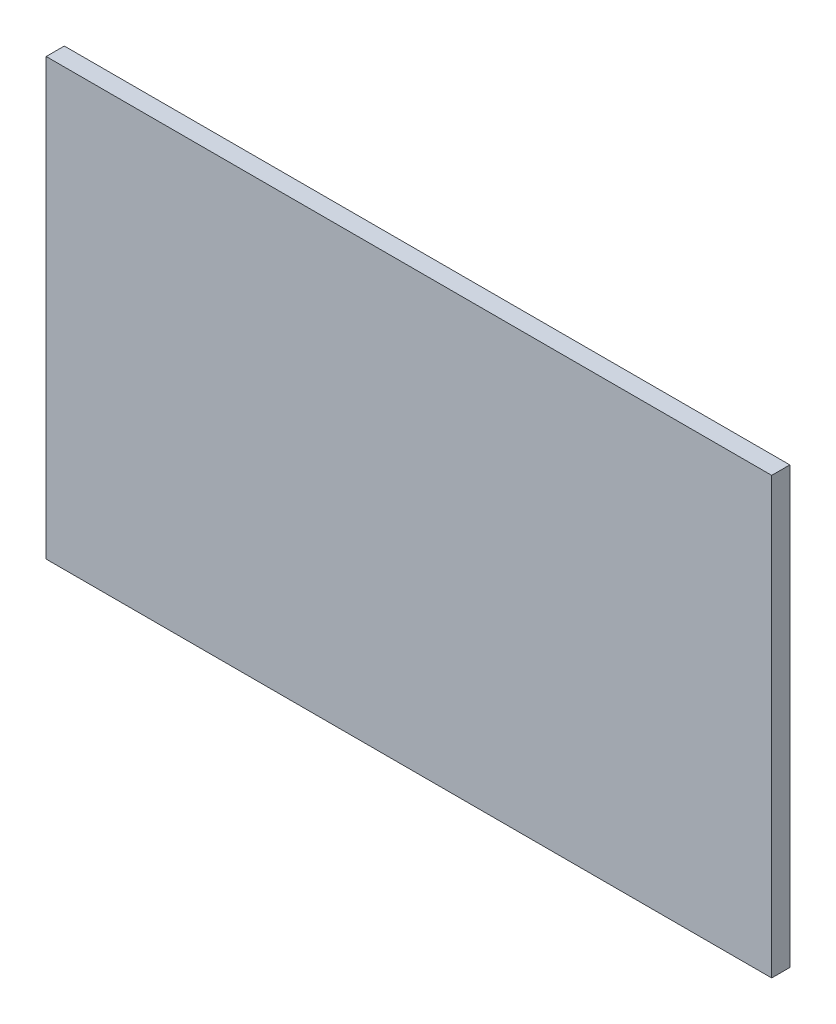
from build123d import *

# Parameters (mm, degrees)
SKETCH1_W           = 254
SKETCH1_H           = 152.4
BOSS_EXTRUDE1_DEPTH = 6.35


with BuildPart() as part:
    # Sketch1 → Boss-Extrude1 (new body)
    with BuildSketch(Plane.XY):
        Rectangle(SKETCH1_W, SKETCH1_H)
    extrude(amount=BOSS_EXTRUDE1_DEPTH)


solid = part.part
